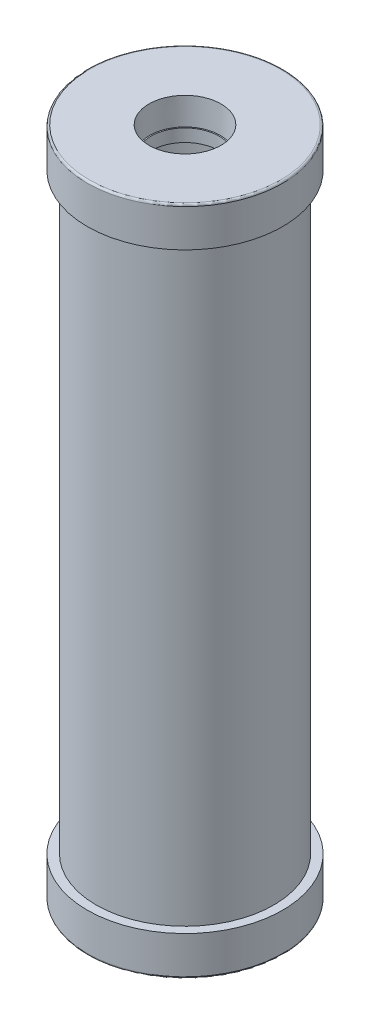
from build123d import *

# Parameters (mm, degrees)
SKETCH1_R           = 57.15
SKETCH1_R_2         = 50.546
BOSS_EXTRUDE1_DEPTH = 431.8
SKETCH2_R           = 62.865
BOSS_EXTRUDE2_DEPTH = 25.4
BOSS_EXTRUDE3_START = -25.4
SKETCH5_R           = 62.865
BOSS_EXTRUDE3_DEPTH = 25.4
FILLET1_R           = 1.27


with BuildPart() as part:
    # Sketch1 → Boss-Extrude1 (new body)
    with BuildSketch(Plane(origin=(0, 0, 0), x_dir=(1, 0, 0), z_dir=(0, 1, 0))):
        with Locations(Location((0, 0, 0), (0, 0, 270))):
            Circle(SKETCH1_R)
        with Locations(Location((0, 0, 0), (0, 0, 270))):
            Circle(SKETCH1_R_2, mode=Mode.SUBTRACT)
    extrude(amount=BOSS_EXTRUDE1_DEPTH)

    # Sketch2 → Boss-Extrude2 (add)
    with BuildSketch(Plane(origin=(0, 0, 0), x_dir=(1, 0, 0), z_dir=(0, 1, 0))):
        with Locations(Location((0, 0, 0), (0, 0, 270))):
            Circle(SKETCH2_R)
    extrude(amount=BOSS_EXTRUDE2_DEPTH)

    # Sketch3 → 1-1_2 NPT Tapped Hole1 (revolve, cut)
    with BuildSketch(Plane(origin=(0, 0, 0), x_dir=(0, 0, -1), z_dir=(1, 0, 0))):
        Polygon((0, 0), (0, 41.565568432), (21.8313, 28.448), (21.8313, 17.272), (22.62588539, 17.272), (23.1430322, 0), align=None)
    revolve(axis=Axis((0, -6.35, 0), (0, 1, 0)), mode=Mode.SUBTRACT)

    # Sketch5 → Boss-Extrude3 (add)
    with BuildSketch(Plane(origin=(0, 431.8, 0), x_dir=(1, 0, 0), z_dir=(0, 1, 0)).offset(BOSS_EXTRUDE3_START)):
        with Locations(Location((0, 0, 0), (0, 0, 270))):
            Circle(SKETCH5_R)
    extrude(amount=BOSS_EXTRUDE3_DEPTH)

    # Sketch6 → 1-1_2 NPT Tapped Hole2 (revolve, cut)
    with BuildSketch(Plane(origin=(0, 431.8, 0), x_dir=(0, 0, 1), z_dir=(1, 0, 0))):
        Polygon((0, 0), (0, 41.565568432), (21.8313, 28.448), (21.8313, 17.272), (22.62588539, 17.272), (23.1430322, 0), align=None)
    revolve(axis=Axis((0, 438.15, 0), (0, -1, 0)), mode=Mode.SUBTRACT)

    # Fillet1
    fillet1_edges = [part.edges().sort_by_distance(p)[0] for p in [
        (0, 0, -62.865),
        (0, 431.8, -62.865),
    ]]
    fillet(fillet1_edges, radius=FILLET1_R)


solid = part.part
